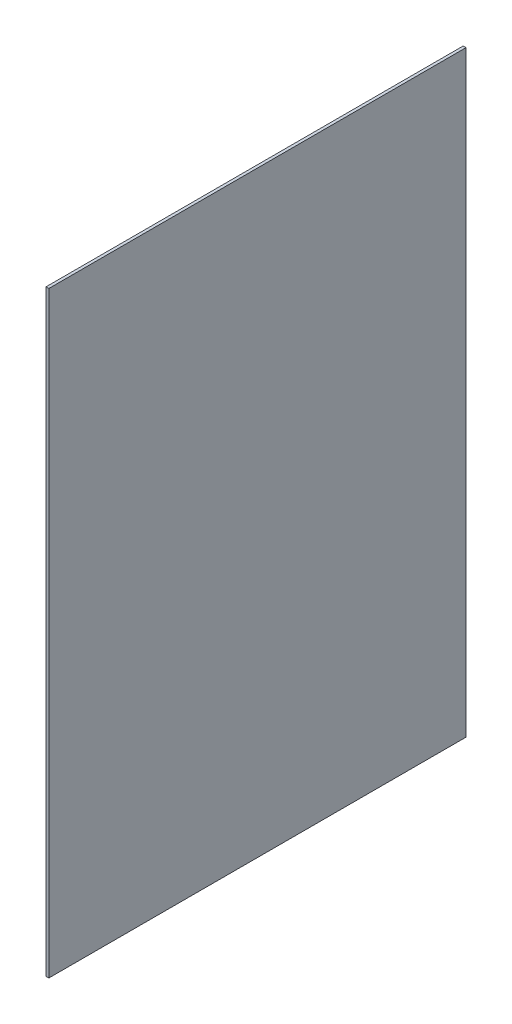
from build123d import *

# Parameters (mm, degrees)
SKETCH1_W           = 440
SKETCH1_H           = 630
BOSS_EXTRUDE1_DEPTH = 3


with BuildPart() as part:
    # Sketch1 → Boss-Extrude1 (new body)
    with BuildSketch(Plane(origin=(0, 0, 0), x_dir=(0, 0, -1), z_dir=(1, 0, 0))):
        with Locations((220, 315)):
            Rectangle(SKETCH1_W, SKETCH1_H)
    extrude(amount=BOSS_EXTRUDE1_DEPTH)


solid = part.part
